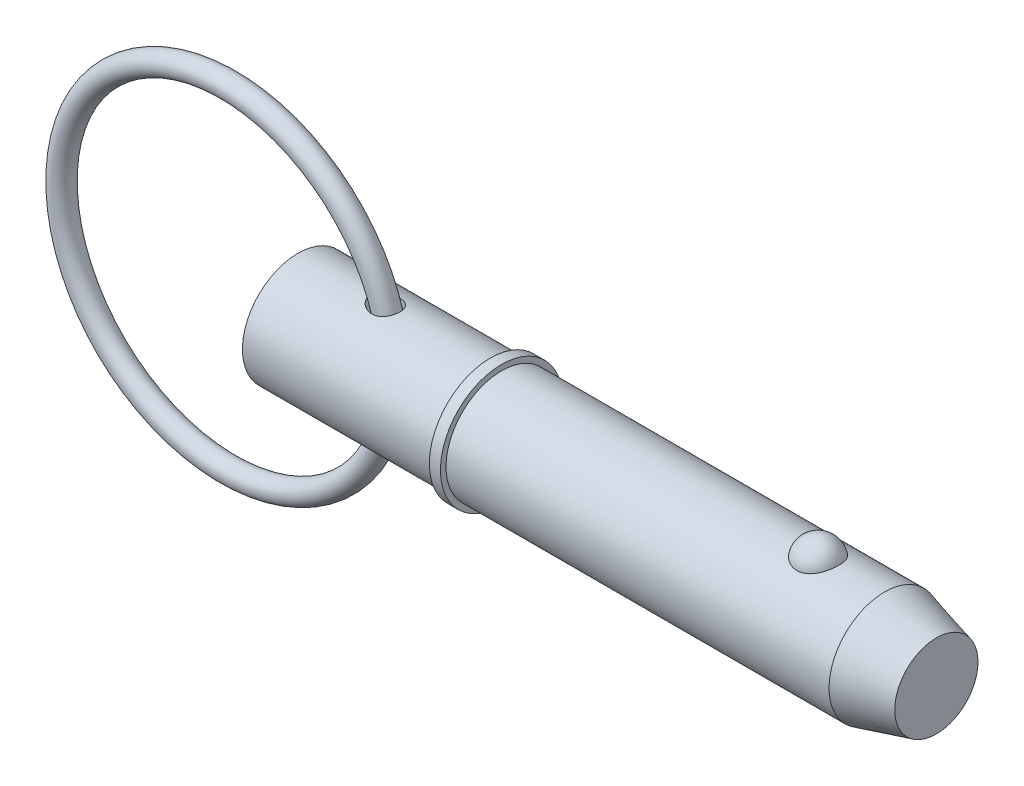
ISO-10303-21;
HEADER;
FILE_DESCRIPTION(('STEP AP214'),'2;1');
FILE_NAME('part.step','',(''),(''),'','','');
FILE_SCHEMA(('AUTOMOTIVE_DESIGN { 1 0 10303 214 1 1 1 1 }'));
ENDSEC;
DATA;
#1=APPLICATION_CONTEXT('core data for automotive mechanical design processes');
#2=APPLICATION_PROTOCOL_DEFINITION('international standard','automotive_design',2000,#1);
#3=PRODUCT_CONTEXT('',#1,'mechanical');
#4=PRODUCT('Part','Part','',(#3));
#5=PRODUCT_RELATED_PRODUCT_CATEGORY('part','',(#4));
#6=PRODUCT_DEFINITION_FORMATION('','',#4);
#7=PRODUCT_DEFINITION_CONTEXT('part definition',#1,'design');
#8=PRODUCT_DEFINITION('design','',#6,#7);
#9=PRODUCT_DEFINITION_SHAPE('','',#8);
#10=(LENGTH_UNIT() NAMED_UNIT(*) SI_UNIT(.MILLI.,.METRE.));
#11=(NAMED_UNIT(*) PLANE_ANGLE_UNIT() SI_UNIT($,.RADIAN.));
#12=(NAMED_UNIT(*) SI_UNIT($,.STERADIAN.) SOLID_ANGLE_UNIT());
#13=UNCERTAINTY_MEASURE_WITH_UNIT(LENGTH_MEASURE(1.E-05),#10,'distance_accuracy_value','');
#14=(GEOMETRIC_REPRESENTATION_CONTEXT(3) GLOBAL_UNCERTAINTY_ASSIGNED_CONTEXT((#13)) GLOBAL_UNIT_ASSIGNED_CONTEXT((#10,
#11,#12)) REPRESENTATION_CONTEXT('',''));
#15=CARTESIAN_POINT('',(0.,0.,0.));
#16=DIRECTION('',(0.,0.,1.));
#17=DIRECTION('',(1.,0.,0.));
#18=AXIS2_PLACEMENT_3D('',#15,#16,#17);
#19=CARTESIAN_POINT('',(-11.9894358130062,0.,0.));
#20=DIRECTION('',(0.,0.,1.));
#21=DIRECTION('',(1.,0.,0.));
#22=AXIS2_PLACEMENT_3D('',#19,#20,#21);
#23=TOROIDAL_SURFACE('',#22,28.575,1.905);
#24=CARTESIAN_POINT('',(18.4905641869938,0.,0.));
#25=VERTEX_POINT('',#24);
#26=VERTEX_LOOP('',#25);
#27=FACE_BOUND('',#26,.T.);
#28=ADVANCED_FACE('P0_F12',(#27),#23,.T.);
#29=CLOSED_SHELL('',(#28));
#30=MANIFOLD_SOLID_BREP('P0_B1',#29);
#31=CARTESIAN_POINT('',(0.,0.,0.));
#32=DIRECTION('',(1.,0.,0.));
#33=DIRECTION('',(0.,0.,-1.));
#34=AXIS2_PLACEMENT_3D('',#31,#32,#33);
#35=CYLINDRICAL_SURFACE('',#34,9.525);
#36=CARTESIAN_POINT('',(12.9513882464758,9.41921920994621,-1.41559473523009));
#37=CARTESIAN_POINT('',(13.0504692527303,9.40163924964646,-1.53256769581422));
#38=CARTESIAN_POINT('',(13.1602600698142,9.38319823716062,-1.64044593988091));
#39=CARTESIAN_POINT('',(13.3966485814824,9.34687220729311,-1.83618480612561));
#40=CARTESIAN_POINT('',(13.5232761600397,9.32898824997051,-1.92400906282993));
#41=CARTESIAN_POINT('',(13.78900694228,9.29593183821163,-2.07784697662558));
#42=CARTESIAN_POINT('',(13.9280753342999,9.28075215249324,-2.14391921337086));
#43=CARTESIAN_POINT('',(14.2153444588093,9.25488828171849,-2.25295850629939));
#44=CARTESIAN_POINT('',(14.3635415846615,9.24420233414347,-2.295934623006));
#45=CARTESIAN_POINT('',(14.669669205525,9.22859713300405,-2.3579005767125));
#46=CARTESIAN_POINT('',(14.8277567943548,9.22385123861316,-2.37617053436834));
#47=CARTESIAN_POINT('',(15.1447573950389,9.22170813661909,-2.38448481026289));
#48=CARTESIAN_POINT('',(15.3036699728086,9.22430739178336,-2.3745427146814));
#49=CARTESIAN_POINT('',(15.6046561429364,9.2363636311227,-2.32717331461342));
#50=CARTESIAN_POINT('',(15.7470893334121,9.24528216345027,-2.29190131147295));
#51=CARTESIAN_POINT('',(16.0228763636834,9.26842607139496,-2.19642882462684));
#52=CARTESIAN_POINT('',(16.1562346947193,9.28264879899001,-2.1362407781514));
#53=CARTESIAN_POINT('',(16.3991522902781,9.31332263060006,-1.99805318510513));
#54=CARTESIAN_POINT('',(16.5097585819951,9.32951023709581,-1.92182839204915));
#55=CARTESIAN_POINT('',(16.7159974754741,9.36298467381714,-1.75147176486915));
#56=CARTESIAN_POINT('',(16.811631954,9.38027136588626,-1.65734217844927));
#57=CARTESIAN_POINT('',(16.9833240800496,9.41356881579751,-1.45618916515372));
#58=CARTESIAN_POINT('',(17.0597719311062,9.42959946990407,-1.34950141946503));
#59=CARTESIAN_POINT('',(17.1939538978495,9.45905380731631,-1.1246201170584));
#60=CARTESIAN_POINT('',(17.2516877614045,9.4724774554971,-1.00642640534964));
#61=CARTESIAN_POINT('',(17.3474400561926,9.49535683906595,-0.760990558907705));
#62=CARTESIAN_POINT('',(17.3853184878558,9.50478431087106,-0.633691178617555));
#63=CARTESIAN_POINT('',(17.4399027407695,9.51852575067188,-0.374363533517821));
#64=CARTESIAN_POINT('',(17.4566077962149,9.52283953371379,-0.242335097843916));
#65=CARTESIAN_POINT('',(17.4685150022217,9.52590431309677,0.0235692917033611));
#66=CARTESIAN_POINT('',(17.4635842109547,9.52462091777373,0.157451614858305));
#67=CARTESIAN_POINT('',(17.4320243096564,9.5165501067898,0.422467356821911));
#68=CARTESIAN_POINT('',(17.4053947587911,9.50976257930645,0.553600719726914));
#69=CARTESIAN_POINT('',(17.3310009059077,9.49140797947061,0.809490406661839));
#70=CARTESIAN_POINT('',(17.2832204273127,9.47983724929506,0.93424176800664));
#71=CARTESIAN_POINT('',(17.1676219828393,9.45318034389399,1.1736825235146));
#72=CARTESIAN_POINT('',(17.0998044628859,9.43809424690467,1.28837214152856));
#73=CARTESIAN_POINT('',(16.9461013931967,9.40614962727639,1.50393386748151));
#74=CARTESIAN_POINT('',(16.8602910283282,9.38929862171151,1.6048606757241));
#75=CARTESIAN_POINT('',(16.6726759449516,9.35566510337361,1.79055313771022));
#76=CARTESIAN_POINT('',(16.5708731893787,9.33888258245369,1.87532077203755));
#77=CARTESIAN_POINT('',(16.3550631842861,9.30741331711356,2.02572386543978));
#78=CARTESIAN_POINT('',(16.2411701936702,9.29270956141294,2.09151983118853));
#79=CARTESIAN_POINT('',(16.0037488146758,9.26681293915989,2.20343355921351));
#80=CARTESIAN_POINT('',(15.8802207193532,9.25561996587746,2.24955191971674));
#81=CARTESIAN_POINT('',(15.6262451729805,9.23779438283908,2.32167613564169));
#82=CARTESIAN_POINT('',(15.4957570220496,9.23119272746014,2.34754561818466));
#83=CARTESIAN_POINT('',(15.2322153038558,9.22318493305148,2.37881082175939));
#84=CARTESIAN_POINT('',(15.0991611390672,9.22178001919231,2.3842017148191));
#85=CARTESIAN_POINT('',(14.8267609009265,9.22414647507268,2.37503099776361));
#86=CARTESIAN_POINT('',(14.6874545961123,9.22819578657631,2.35939810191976));
#87=CARTESIAN_POINT('',(14.412976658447,9.24129253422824,2.30756034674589));
#88=CARTESIAN_POINT('',(14.2778066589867,9.25034191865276,2.27134746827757));
#89=CARTESIAN_POINT('',(14.0027915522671,9.27334688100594,2.17561454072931));
#90=CARTESIAN_POINT('',(13.8635960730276,9.28766658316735,2.11431132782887));
#91=CARTESIAN_POINT('',(13.5969045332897,9.31925368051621,1.97041856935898));
#92=CARTESIAN_POINT('',(13.4694182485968,9.33652350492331,1.88781145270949));
#93=CARTESIAN_POINT('',(13.2243568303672,9.37286659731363,1.69844580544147));
#94=CARTESIAN_POINT('',(13.1075060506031,9.39198626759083,1.5907521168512));
#95=CARTESIAN_POINT('',(12.8957171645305,9.42881110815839,1.35544651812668));
#96=CARTESIAN_POINT('',(12.8007455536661,9.44651841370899,1.22786557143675));
#97=CARTESIAN_POINT('',(12.6580495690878,9.4741137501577,0.98872437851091));
#98=CARTESIAN_POINT('',(12.604453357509,9.4848570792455,0.880756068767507));
#99=CARTESIAN_POINT('',(12.515693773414,9.50295777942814,0.657225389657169));
#100=CARTESIAN_POINT('',(12.4805142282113,9.51031812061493,0.54166978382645));
#101=CARTESIAN_POINT('',(12.4305797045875,9.52083647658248,0.305475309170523));
#102=CARTESIAN_POINT('',(12.4159122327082,9.52397648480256,0.184816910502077));
#103=CARTESIAN_POINT('',(12.408320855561,9.52559626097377,-0.0572308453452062));
#104=CARTESIAN_POINT('',(12.4153963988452,9.52407614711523,-0.178620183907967));
#105=CARTESIAN_POINT('',(12.4495068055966,9.51684301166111,-0.409566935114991));
#106=CARTESIAN_POINT('',(12.4750931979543,9.51143444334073,-0.519353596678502));
#107=CARTESIAN_POINT('',(12.543120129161,9.49733710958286,-0.733285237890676));
#108=CARTESIAN_POINT('',(12.5855568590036,9.4886490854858,-0.837431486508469));
#109=CARTESIAN_POINT('',(12.6780792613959,9.47023833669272,-1.02356028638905));
#110=CARTESIAN_POINT('',(12.7261842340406,9.46084463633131,-1.10657511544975));
#111=CARTESIAN_POINT('',(12.8319313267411,9.44081892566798,-1.26610577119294));
#112=CARTESIAN_POINT('',(12.8895756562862,9.43018662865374,-1.34262008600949));
#113=CARTESIAN_POINT('',(12.9513882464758,9.41921920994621,-1.41559473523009));
#114=B_SPLINE_CURVE_WITH_KNOTS('',3,(#36,#37,#38,#39,#40,#41,#42,#43,#44,#45,#46,#47,#48,#49,
#50,#51,#52,#53,#54,#55,#56,#57,#58,#59,#60,#61,#62,#63,#64,#65,#66,#67,#68,#69,#70,#71,#72,#73,
#74,#75,#76,#77,#78,#79,#80,#81,#82,#83,#84,#85,#86,#87,#88,#89,#90,#91,#92,#93,#94,#95,#96,#97,
#98,#99,#100,#101,#102,#103,#104,#105,#106,#107,#108,#109,#110,#111,#112,#113),.UNSPECIFIED.,
.T.,.F.,(4,2,2,2,2,2,2,2,2,2,2,2,2,2,2,2,2,2,2,2,2,2,2,2,2,2,2,2,2,2,2,2,2,2,2,2,2,2,4),(0.,
0.462524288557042,0.925880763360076,1.3879789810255,1.84989578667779,2.32500103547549,
2.79987752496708,3.23851602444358,3.67693583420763,4.08084875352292,4.48471100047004,
4.87953549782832,5.27436531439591,5.67194282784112,6.0695347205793,6.46957303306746,
6.86961947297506,7.26997240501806,7.67031642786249,8.06901977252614,8.46767421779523,
8.86284969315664,9.25801315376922,9.65581560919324,10.0537118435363,10.4726706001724,
10.8917927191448,11.3481090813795,11.8048030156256,12.2824769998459,12.7594145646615,
13.1209614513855,13.4821903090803,13.8449555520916,14.2077115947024,14.5447865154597,
14.881785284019,15.170268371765,15.4588183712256),.UNSPECIFIED.);
#115=CARTESIAN_POINT('',(12.9513882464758,9.41921920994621,-1.41559473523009));
#116=VERTEX_POINT('',#115);
#117=EDGE_CURVE('P1_E42',#116,#116,#114,.T.);
#118=ORIENTED_EDGE('',*,*,#117,.T.);
#119=EDGE_LOOP('',(#118));
#120=FACE_BOUND('',#119,.T.);
#121=CARTESIAN_POINT('',(0.,0.,0.));
#122=DIRECTION('',(1.,0.,0.));
#123=DIRECTION('',(0.,0.,-1.));
#124=AXIS2_PLACEMENT_3D('',#121,#122,#123);
#125=CIRCLE('',#124,9.525);
#126=CARTESIAN_POINT('',(0.,0.,-9.525));
#127=VERTEX_POINT('',#126);
#128=EDGE_CURVE('P1_E9',#127,#127,#125,.T.);
#129=ORIENTED_EDGE('',*,*,#128,.T.);
#130=EDGE_LOOP('',(#129));
#131=FACE_BOUND('',#130,.T.);
#132=CARTESIAN_POINT('',(33.025,0.,0.));
#133=DIRECTION('',(1.,0.,0.));
#134=DIRECTION('',(0.,0.,-1.));
#135=AXIS2_PLACEMENT_3D('',#132,#133,#134);
#136=CIRCLE('',#135,9.525);
#137=CARTESIAN_POINT('',(33.025,0.,-9.525));
#138=VERTEX_POINT('',#137);
#139=EDGE_CURVE('P1_E25',#138,#138,#136,.T.);
#140=ORIENTED_EDGE('',*,*,#139,.F.);
#141=EDGE_LOOP('',(#140));
#142=FACE_BOUND('',#141,.T.);
#143=CARTESIAN_POINT('',(12.9513882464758,-9.41921920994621,-1.41559473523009));
#144=CARTESIAN_POINT('',(12.8706569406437,-9.43354320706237,-1.32028288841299));
#145=CARTESIAN_POINT('',(12.7970077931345,-9.44729974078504,-1.21890449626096));
#146=CARTESIAN_POINT('',(12.6667099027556,-9.47239055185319,-1.00546491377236));
#147=CARTESIAN_POINT('',(12.6100480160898,-9.48372669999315,-0.893412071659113));
#148=CARTESIAN_POINT('',(12.5163428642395,-9.50281544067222,-0.660202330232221));
#149=CARTESIAN_POINT('',(12.4794216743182,-9.51054569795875,-0.538993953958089));
#150=CARTESIAN_POINT('',(12.4282252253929,-9.52133525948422,-0.29167282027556));
#151=CARTESIAN_POINT('',(12.4139371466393,-9.52439720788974,-0.165562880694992));
#152=CARTESIAN_POINT('',(12.4092595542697,-9.52539668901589,0.0763263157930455));
#153=CARTESIAN_POINT('',(12.4169377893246,-9.5237485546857,0.192070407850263));
#154=CARTESIAN_POINT('',(12.4515961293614,-9.51640070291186,0.420478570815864));
#155=CARTESIAN_POINT('',(12.4785770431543,-9.51070081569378,0.533142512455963));
#156=CARTESIAN_POINT('',(12.5496371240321,-9.49599978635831,0.750537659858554));
#157=CARTESIAN_POINT('',(12.5934215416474,-9.48705569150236,0.855370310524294));
#158=CARTESIAN_POINT('',(12.6960201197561,-9.46670226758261,1.05710432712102));
#159=CARTESIAN_POINT('',(12.754838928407,-9.45529217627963,1.15400322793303));
#160=CARTESIAN_POINT('',(12.8926588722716,-9.42958102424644,1.34883014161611));
#161=CARTESIAN_POINT('',(12.9731843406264,-9.41509922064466,1.44565277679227));
#162=CARTESIAN_POINT('',(13.1473692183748,-9.38554264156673,1.62653953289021));
#163=CARTESIAN_POINT('',(13.2410364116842,-9.37046751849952,1.71059603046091));
#164=CARTESIAN_POINT('',(13.454392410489,-9.33867330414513,1.87697964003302));
#165=CARTESIAN_POINT('',(13.5758667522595,-9.32205896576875,1.95704323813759));
#166=CARTESIAN_POINT('',(13.8299208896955,-9.29140277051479,2.09777392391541));
#167=CARTESIAN_POINT('',(13.9625074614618,-9.27736250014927,2.15842906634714));
#168=CARTESIAN_POINT('',(14.2477938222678,-9.25234849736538,2.26337318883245));
#169=CARTESIAN_POINT('',(14.4012368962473,-9.2417532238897,2.30575283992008));
#170=CARTESIAN_POINT('',(14.7134258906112,-9.22706044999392,2.36387471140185));
#171=CARTESIAN_POINT('',(14.8721705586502,-9.22296142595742,2.37962317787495));
#172=CARTESIAN_POINT('',(15.1841930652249,-9.22219798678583,2.3825815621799));
#173=CARTESIAN_POINT('',(15.3374581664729,-9.22526675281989,2.37081567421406));
#174=CARTESIAN_POINT('',(15.6390558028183,-9.23821642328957,2.31984408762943));
#175=CARTESIAN_POINT('',(15.7873916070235,-9.24809271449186,2.28065697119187));
#176=CARTESIAN_POINT('',(16.0605055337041,-9.27231045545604,2.17997072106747));
#177=CARTESIAN_POINT('',(16.1861988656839,-9.28616347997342,2.12082794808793));
#178=CARTESIAN_POINT('',(16.4248737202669,-9.31689725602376,1.98144352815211));
#179=CARTESIAN_POINT('',(16.5378583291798,-9.33377726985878,1.90120701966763));
#180=CARTESIAN_POINT('',(16.7424913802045,-9.36766057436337,1.72629138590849));
#181=CARTESIAN_POINT('',(16.8349077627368,-9.38461836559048,1.63249912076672));
#182=CARTESIAN_POINT('',(17.0025959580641,-9.41752009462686,1.43052052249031));
#183=CARTESIAN_POINT('',(17.0778684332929,-9.43346407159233,1.32233474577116));
#184=CARTESIAN_POINT('',(17.2093311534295,-9.46256896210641,1.09477833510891));
#185=CARTESIAN_POINT('',(17.2655443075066,-9.47573320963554,0.975421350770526));
#186=CARTESIAN_POINT('',(17.3577240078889,-9.49788660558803,0.72876499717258));
#187=CARTESIAN_POINT('',(17.3936897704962,-9.5068755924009,0.601465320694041));
#188=CARTESIAN_POINT('',(17.4447894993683,-9.51977728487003,0.341392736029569));
#189=CARTESIAN_POINT('',(17.4597470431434,-9.52364698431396,0.208583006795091));
#190=CARTESIAN_POINT('',(17.467935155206,-9.52575588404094,-0.0577507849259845));
#191=CARTESIAN_POINT('',(17.4611651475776,-9.52399493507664,-0.191274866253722));
#192=CARTESIAN_POINT('',(17.4259933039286,-9.51501704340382,-0.455658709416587));
#193=CARTESIAN_POINT('',(17.3975278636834,-9.50778405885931,-0.586509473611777));
#194=CARTESIAN_POINT('',(17.3195245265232,-9.48862442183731,-0.841413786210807));
#195=CARTESIAN_POINT('',(17.2699864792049,-9.47669773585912,-0.965467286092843));
#196=CARTESIAN_POINT('',(17.1510794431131,-9.44947793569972,-1.20302860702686));
#197=CARTESIAN_POINT('',(17.0817421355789,-9.43419020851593,-1.31655289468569));
#198=CARTESIAN_POINT('',(16.9249035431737,-9.40193593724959,-1.52999797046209));
#199=CARTESIAN_POINT('',(16.8374037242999,-9.38496952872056,-1.62991985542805));
#200=CARTESIAN_POINT('',(16.6472525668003,-9.35139745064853,-1.81261591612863));
#201=CARTESIAN_POINT('',(16.544718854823,-9.33479003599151,-1.89551219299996));
#202=CARTESIAN_POINT('',(16.3268885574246,-9.30366076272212,-2.04284430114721));
#203=CARTESIAN_POINT('',(16.2115933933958,-9.28913867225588,-2.10728218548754));
#204=CARTESIAN_POINT('',(15.9721327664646,-9.26380878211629,-2.21598517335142));
#205=CARTESIAN_POINT('',(15.8480095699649,-9.25298455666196,-2.26033977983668));
#206=CARTESIAN_POINT('',(15.5939970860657,-9.23601616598,-2.32870721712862));
#207=CARTESIAN_POINT('',(15.4641070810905,-9.22987258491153,-2.35271750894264));
#208=CARTESIAN_POINT('',(15.1982340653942,-9.22261892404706,-2.38099747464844));
#209=CARTESIAN_POINT('',(15.0621840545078,-9.22166165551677,-2.38466791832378));
#210=CARTESIAN_POINT('',(14.7911713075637,-9.22504733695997,-2.37153091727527));
#211=CARTESIAN_POINT('',(14.6562088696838,-9.22939169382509,-2.35471803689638));
#212=CARTESIAN_POINT('',(14.3799999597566,-9.24325361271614,-2.29972931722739));
#213=CARTESIAN_POINT('',(14.2390842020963,-9.25314817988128,-2.25998976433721));
#214=CARTESIAN_POINT('',(13.9651910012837,-9.2770918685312,-2.15959208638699));
#215=CARTESIAN_POINT('',(13.8322212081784,-9.29114491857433,-2.09891417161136));
#216=CARTESIAN_POINT('',(13.5621642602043,-9.32369066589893,-1.94960068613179));
#217=CARTESIAN_POINT('',(13.4264724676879,-9.34251276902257,-1.85849626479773));
#218=CARTESIAN_POINT('',(13.1736579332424,-9.38095091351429,-1.6535412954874));
#219=CARTESIAN_POINT('',(13.0565182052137,-9.40056620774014,-1.53971177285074));
#220=CARTESIAN_POINT('',(12.9513882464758,-9.41921920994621,-1.41559473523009));
#221=B_SPLINE_CURVE_WITH_KNOTS('',3,(#143,#144,#145,#146,#147,#148,#149,#150,#151,#152,#153,
#154,#155,#156,#157,#158,#159,#160,#161,#162,#163,#164,#165,#166,#167,#168,#169,#170,#171,#172,
#173,#174,#175,#176,#177,#178,#179,#180,#181,#182,#183,#184,#185,#186,#187,#188,#189,#190,#191,
#192,#193,#194,#195,#196,#197,#198,#199,#200,#201,#202,#203,#204,#205,#206,#207,#208,#209,#210,
#211,#212,#213,#214,#215,#216,#217,#218,#219,#220),.UNSPECIFIED.,.T.,.F.,(4,2,2,2,2,2,2,2,2,2,2,
2,2,2,2,2,2,2,2,2,2,2,2,2,2,2,2,2,2,2,2,2,2,2,2,2,2,2,4),(0.,0.37674646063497,0.753200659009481,
1.13195666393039,1.51049805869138,1.85679105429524,2.20309856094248,2.54359033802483,
2.88418751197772,3.26301611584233,3.64207005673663,4.07954912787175,4.51729693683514,
4.99355673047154,5.46970480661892,5.92841231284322,6.38680927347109,6.80346940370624,
7.2200281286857,7.61642768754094,8.01281192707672,8.4087180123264,8.8046394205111,
9.20386620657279,9.60310357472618,10.0035159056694,10.4039310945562,10.8037091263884,
11.2034549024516,11.6002252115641,11.9969513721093,12.3918916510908,12.7868812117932,
13.1934480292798,13.6001227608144,14.038511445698,14.4773156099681,14.9683748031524,
15.4589817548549),.UNSPECIFIED.);
#222=CARTESIAN_POINT('',(12.9513882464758,-9.41921920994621,-1.41559473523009));
#223=VERTEX_POINT('',#222);
#224=EDGE_CURVE('P1_E17',#223,#223,#221,.T.);
#225=ORIENTED_EDGE('',*,*,#224,.T.);
#226=EDGE_LOOP('',(#225));
#227=FACE_BOUND('',#226,.T.);
#228=ADVANCED_FACE('P1_F13',(#120,#131,#142,#227),#35,.T.);
#229=CARTESIAN_POINT('',(0.,0.,0.));
#230=DIRECTION('',(1.,0.,0.));
#231=DIRECTION('',(0.,0.,-1.));
#232=AXIS2_PLACEMENT_3D('',#229,#230,#231);
#233=CYLINDRICAL_SURFACE('',#232,9.525);
#234=CARTESIAN_POINT('',(100.643054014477,0.,0.));
#235=DIRECTION('',(1.,0.,0.));
#236=DIRECTION('',(0.,0.,-1.));
#237=AXIS2_PLACEMENT_3D('',#234,#235,#236);
#238=CIRCLE('',#237,9.525);
#239=CARTESIAN_POINT('',(100.643054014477,0.,-9.525));
#240=VERTEX_POINT('',#239);
#241=EDGE_CURVE('P1_E99',#240,#240,#238,.T.);
#242=ORIENTED_EDGE('',*,*,#241,.F.);
#243=EDGE_LOOP('',(#242));
#244=FACE_BOUND('',#243,.T.);
#245=CARTESIAN_POINT('',(34.93,0.,0.));
#246=DIRECTION('',(1.,0.,0.));
#247=DIRECTION('',(0.,0.,-1.));
#248=AXIS2_PLACEMENT_3D('',#245,#246,#247);
#249=CIRCLE('',#248,9.525);
#250=CARTESIAN_POINT('',(34.93,0.,-9.525));
#251=VERTEX_POINT('',#250);
#252=EDGE_CURVE('P1_E96',#251,#251,#249,.T.);
#253=ORIENTED_EDGE('',*,*,#252,.T.);
#254=EDGE_LOOP('',(#253));
#255=FACE_BOUND('',#254,.T.);
#256=CARTESIAN_POINT('',(89.2457573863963,8.80405803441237,3.63513233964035));
#257=CARTESIAN_POINT('',(89.1516766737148,8.80405953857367,3.63513053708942));
#258=CARTESIAN_POINT('',(89.0575618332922,8.80561325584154,3.6313746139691));
#259=CARTESIAN_POINT('',(88.8700126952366,8.81177748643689,3.61638665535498));
#260=CARTESIAN_POINT('',(88.7765788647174,8.81638992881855,3.60514990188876));
#261=CARTESIAN_POINT('',(88.4979452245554,8.8346711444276,3.56024627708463));
#262=CARTESIAN_POINT('',(88.3146916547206,8.85278327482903,3.51538626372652));
#263=CARTESIAN_POINT('',(87.9595099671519,8.89871214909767,3.39742145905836));
#264=CARTESIAN_POINT('',(87.7875533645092,8.92650327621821,3.32439116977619));
#265=CARTESIAN_POINT('',(87.458707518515,8.98874819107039,3.15220244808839));
#266=CARTESIAN_POINT('',(87.3018114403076,9.02319893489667,3.05305594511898));
#267=CARTESIAN_POINT('',(87.0022147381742,9.09629186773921,2.82797815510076));
#268=CARTESIAN_POINT('',(86.8600600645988,9.13502685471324,2.70135138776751));
#269=CARTESIAN_POINT('',(86.5982999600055,9.2118657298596,2.42641932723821));
#270=CARTESIAN_POINT('',(86.4787015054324,9.2499694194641,2.27810735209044));
#271=CARTESIAN_POINT('',(86.259645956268,9.32341082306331,1.95652290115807));
#272=CARTESIAN_POINT('',(86.1613174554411,9.35855090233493,1.78243511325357));
#273=CARTESIAN_POINT('',(85.9938190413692,9.42045142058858,1.41937246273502));
#274=CARTESIAN_POINT('',(85.9246511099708,9.44721128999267,1.23039658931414));
#275=CARTESIAN_POINT('',(85.8161994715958,9.48990641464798,0.840370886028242));
#276=CARTESIAN_POINT('',(85.7772880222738,9.50570658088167,0.639202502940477));
#277=CARTESIAN_POINT('',(85.7315550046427,9.52433146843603,0.232664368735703));
#278=CARTESIAN_POINT('',(85.7247324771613,9.52715657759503,0.0272947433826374));
#279=CARTESIAN_POINT('',(85.743255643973,9.51956918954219,-0.380478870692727));
#280=CARTESIAN_POINT('',(85.7684052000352,9.50923740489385,-0.582893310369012));
#281=CARTESIAN_POINT('',(85.8500253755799,9.47651897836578,-0.98029399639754));
#282=CARTESIAN_POINT('',(85.9064966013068,9.45413210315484,-1.17528009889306));
#283=CARTESIAN_POINT('',(86.0497192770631,9.39954044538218,-1.55263697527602));
#284=CARTESIAN_POINT('',(86.1365124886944,9.36732213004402,-1.73498993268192));
#285=CARTESIAN_POINT('',(86.3386103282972,9.29640700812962,-2.08177763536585));
#286=CARTESIAN_POINT('',(86.4539172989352,9.25770966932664,-2.24621090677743));
#287=CARTESIAN_POINT('',(86.711264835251,9.17775604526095,-2.55338333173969));
#288=CARTESIAN_POINT('',(86.8534344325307,9.136488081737,-2.69601150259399));
#289=CARTESIAN_POINT('',(87.16089985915,9.05620497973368,-2.95451229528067));
#290=CARTESIAN_POINT('',(87.3261937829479,9.01718965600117,-3.07038711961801));
#291=CARTESIAN_POINT('',(87.672052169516,8.94680019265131,-3.26976836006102));
#292=CARTESIAN_POINT('',(87.8522278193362,8.91528408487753,-3.353897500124));
#293=CARTESIAN_POINT('',(88.2256514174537,8.86272514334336,-3.49043503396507));
#294=CARTESIAN_POINT('',(88.4188944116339,8.84167836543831,-3.54285537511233));
#295=CARTESIAN_POINT('',(88.8025036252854,8.81348056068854,-3.61241306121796));
#296=CARTESIAN_POINT('',(88.9925251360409,8.80568348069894,-3.63119339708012));
#297=CARTESIAN_POINT('',(89.3731906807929,8.80289410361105,-3.63795342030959));
#298=CARTESIAN_POINT('',(89.5638345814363,8.80789922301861,-3.62593932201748));
#299=CARTESIAN_POINT('',(89.9340076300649,8.82974915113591,-3.57238430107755));
#300=CARTESIAN_POINT('',(90.1136976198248,8.84621463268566,-3.53178890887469));
#301=CARTESIAN_POINT('',(90.463422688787,8.88875330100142,-3.42331083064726));
#302=CARTESIAN_POINT('',(90.6334569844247,8.91482726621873,-3.35542593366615));
#303=CARTESIAN_POINT('',(90.9632377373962,8.97448239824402,-3.19248225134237));
#304=CARTESIAN_POINT('',(91.1226801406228,9.00821446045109,-3.09686474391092));
#305=CARTESIAN_POINT('',(91.4235136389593,9.07935398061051,-2.88162736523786));
#306=CARTESIAN_POINT('',(91.5649005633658,9.11676228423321,-2.76200196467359));
#307=CARTESIAN_POINT('',(91.8333193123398,9.19347419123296,-2.49516285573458));
#308=CARTESIAN_POINT('',(91.9592750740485,9.23277872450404,-2.34686614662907));
#309=CARTESIAN_POINT('',(92.1855227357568,9.30737610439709,-2.03093683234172));
#310=CARTESIAN_POINT('',(92.2858100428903,9.34266823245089,-1.86330077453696));
#311=CARTESIAN_POINT('',(92.4615149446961,9.40674710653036,-1.50744893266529));
#312=CARTESIAN_POINT('',(92.536041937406,9.43529176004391,-1.31874876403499));
#313=CARTESIAN_POINT('',(92.6541650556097,9.48144132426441,-0.930631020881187));
#314=CARTESIAN_POINT('',(92.6977608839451,9.49904612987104,-0.731213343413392));
#315=CARTESIAN_POINT('',(92.7531580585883,9.5215314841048,-0.327147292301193));
#316=CARTESIAN_POINT('',(92.7649354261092,9.52640243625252,-0.12249509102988));
#317=CARTESIAN_POINT('',(92.7563825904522,9.5228957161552,0.286018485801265));
#318=CARTESIAN_POINT('',(92.7360530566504,9.5145183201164,0.489879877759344));
#319=CARTESIAN_POINT('',(92.6638840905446,9.48544083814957,0.889994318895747));
#320=CARTESIAN_POINT('',(92.6121993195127,9.46480124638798,1.08627971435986));
#321=CARTESIAN_POINT('',(92.4784917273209,9.4133389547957,1.46682086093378));
#322=CARTESIAN_POINT('',(92.3964668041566,9.38251554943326,1.65107577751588));
#323=CARTESIAN_POINT('',(92.2031929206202,9.31365636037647,2.00346348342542));
#324=CARTESIAN_POINT('',(92.0917838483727,9.27558138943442,2.17150083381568));
#325=CARTESIAN_POINT('',(91.8422947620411,9.19638714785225,2.48563115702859));
#326=CARTESIAN_POINT('',(91.7042163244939,9.15526805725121,2.63172542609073));
#327=CARTESIAN_POINT('',(91.4048438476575,9.07465393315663,2.89750997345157));
#328=CARTESIAN_POINT('',(91.2436109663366,9.03515496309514,3.01726776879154));
#329=CARTESIAN_POINT('',(90.9016136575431,8.96227564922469,3.22732920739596));
#330=CARTESIAN_POINT('',(90.720841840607,8.92889763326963,3.31762165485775));
#331=CARTESIAN_POINT('',(90.3514451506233,8.8734538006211,3.46314419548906));
#332=CARTESIAN_POINT('',(90.1633237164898,8.85102983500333,3.51950082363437));
#333=CARTESIAN_POINT('',(89.8757869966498,8.8266696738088,3.57993683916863));
#334=CARTESIAN_POINT('',(89.7791339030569,8.82009725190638,3.59606217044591));
#335=CARTESIAN_POINT('',(89.5846770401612,8.81020897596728,3.62022512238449));
#336=CARTESIAN_POINT('',(89.4868741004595,8.80689090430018,3.62826825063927));
#337=CARTESIAN_POINT('',(89.3412243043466,8.80445615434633,3.63416760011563));
#338=CARTESIAN_POINT('',(89.2934952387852,8.80405727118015,3.63513325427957));
#339=CARTESIAN_POINT('',(89.2457573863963,8.80405803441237,3.63513233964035));
#340=B_SPLINE_CURVE_WITH_KNOTS('',3,(#256,#257,#258,#259,#260,#261,#262,#263,#264,#265,#266,
#267,#268,#269,#270,#271,#272,#273,#274,#275,#276,#277,#278,#279,#280,#281,#282,#283,#284,#285,
#286,#287,#288,#289,#290,#291,#292,#293,#294,#295,#296,#297,#298,#299,#300,#301,#302,#303,#304,
#305,#306,#307,#308,#309,#310,#311,#312,#313,#314,#315,#316,#317,#318,#319,#320,#321,#322,#323,
#324,#325,#326,#327,#328,#329,#330,#331,#332,#333,#334,#335,#336,#337,#338,#339),.UNSPECIFIED.,
.T.,.F.,(4,2,2,2,2,2,2,2,2,2,2,2,2,2,2,2,2,2,2,2,2,2,2,2,2,2,2,2,2,2,2,2,2,2,2,2,2,2,2,2,2,4),
(0.,0.282202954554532,0.564584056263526,1.13017050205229,1.69427128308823,2.25811483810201,
2.83836627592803,3.41879688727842,4.02497117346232,4.63118665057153,5.24474754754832,
5.85829010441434,6.46808687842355,7.07789545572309,7.68854723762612,8.29924920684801,
8.9129628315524,9.52662591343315,10.1275338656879,10.7282152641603,11.2986646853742,
11.868998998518,12.4213015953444,12.973648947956,13.5380053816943,14.1024919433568,
14.695298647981,15.2882113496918,15.8999469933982,16.5116885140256,17.1238909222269,
17.7360805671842,18.3452748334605,18.9545113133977,19.567138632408,20.1797297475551,
20.7907316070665,21.4019653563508,21.9915938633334,22.2859053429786,22.5800161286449,
22.723209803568),.UNSPECIFIED.);
#341=CARTESIAN_POINT('',(89.2457573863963,8.80405803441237,3.63513233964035));
#342=VERTEX_POINT('',#341);
#343=EDGE_CURVE('P1_E34',#342,#342,#340,.T.);
#344=ORIENTED_EDGE('',*,*,#343,.T.);
#345=EDGE_LOOP('',(#344));
#346=FACE_BOUND('',#345,.T.);
#347=ADVANCED_FACE('P1_F46',(#244,#255,#346),#233,.T.);
#348=CARTESIAN_POINT('',(0.,0.,0.));
#349=DIRECTION('',(-1.,0.,0.));
#350=DIRECTION('',(0.,0.,1.));
#351=AXIS2_PLACEMENT_3D('',#348,#349,#350);
#352=PLANE('',#351);
#353=ORIENTED_EDGE('',*,*,#128,.F.);
#354=EDGE_LOOP('',(#353));
#355=FACE_BOUND('',#354,.T.);
#356=ADVANCED_FACE('P1_F15',(#355),#352,.T.);
#357=CARTESIAN_POINT('',(33.025,9.525,0.));
#358=DIRECTION('',(-1.,0.,0.));
#359=DIRECTION('',(0.,0.,1.));
#360=AXIS2_PLACEMENT_3D('',#357,#358,#359);
#361=PLANE('',#360);
#362=ORIENTED_EDGE('',*,*,#139,.T.);
#363=EDGE_LOOP('',(#362));
#364=FACE_BOUND('',#363,.T.);
#365=CARTESIAN_POINT('',(33.025,0.,0.));
#366=DIRECTION('',(1.,0.,0.));
#367=DIRECTION('',(0.,0.,-1.));
#368=AXIS2_PLACEMENT_3D('',#365,#366,#367);
#369=CIRCLE('',#368,10.4775);
#370=CARTESIAN_POINT('',(33.025,0.,-10.4775));
#371=VERTEX_POINT('',#370);
#372=EDGE_CURVE('P1_E30',#371,#371,#369,.T.);
#373=ORIENTED_EDGE('',*,*,#372,.F.);
#374=EDGE_LOOP('',(#373));
#375=FACE_BOUND('',#374,.T.);
#376=ADVANCED_FACE('P1_F81',(#364,#375),#361,.T.);
#377=CARTESIAN_POINT('',(0.,0.,0.));
#378=DIRECTION('',(1.,0.,0.));
#379=DIRECTION('',(0.,0.,-1.));
#380=AXIS2_PLACEMENT_3D('',#377,#378,#379);
#381=CYLINDRICAL_SURFACE('',#380,10.4775);
#382=ORIENTED_EDGE('',*,*,#372,.T.);
#383=EDGE_LOOP('',(#382));
#384=FACE_BOUND('',#383,.T.);
#385=CARTESIAN_POINT('',(34.93,0.,0.));
#386=DIRECTION('',(1.,0.,0.));
#387=DIRECTION('',(0.,0.,-1.));
#388=AXIS2_PLACEMENT_3D('',#385,#386,#387);
#389=CIRCLE('',#388,10.4775);
#390=CARTESIAN_POINT('',(34.93,0.,-10.4775));
#391=VERTEX_POINT('',#390);
#392=EDGE_CURVE('P1_E95',#391,#391,#389,.T.);
#393=ORIENTED_EDGE('',*,*,#392,.F.);
#394=EDGE_LOOP('',(#393));
#395=FACE_BOUND('',#394,.T.);
#396=ADVANCED_FACE('P1_F68',(#384,#395),#381,.T.);
#397=CARTESIAN_POINT('',(34.93,10.4775,0.));
#398=DIRECTION('',(1.,0.,0.));
#399=DIRECTION('',(0.,0.,-1.));
#400=AXIS2_PLACEMENT_3D('',#397,#398,#399);
#401=PLANE('',#400);
#402=ORIENTED_EDGE('',*,*,#392,.T.);
#403=EDGE_LOOP('',(#402));
#404=FACE_BOUND('',#403,.T.);
#405=ORIENTED_EDGE('',*,*,#252,.F.);
#406=EDGE_LOOP('',(#405));
#407=FACE_BOUND('',#406,.T.);
#408=ADVANCED_FACE('P1_F62',(#404,#407),#401,.T.);
#409=CARTESIAN_POINT('',(109.53,0.,0.));
#410=DIRECTION('',(-1.,0.,0.));
#411=DIRECTION('',(0.,0.,1.));
#412=AXIS2_PLACEMENT_3D('',#409,#410,#411);
#413=CONICAL_SURFACE('',#412,7.14375000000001,0.261799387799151);
#414=ORIENTED_EDGE('',*,*,#241,.T.);
#415=EDGE_LOOP('',(#414));
#416=FACE_BOUND('',#415,.T.);
#417=CARTESIAN_POINT('',(109.53,0.,0.));
#418=DIRECTION('',(1.,0.,0.));
#419=DIRECTION('',(0.,0.,-1.));
#420=AXIS2_PLACEMENT_3D('',#417,#418,#419);
#421=CIRCLE('',#420,7.14375000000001);
#422=CARTESIAN_POINT('',(109.53,0.,-7.14375000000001));
#423=VERTEX_POINT('',#422);
#424=EDGE_CURVE('P1_E41',#423,#423,#421,.T.);
#425=ORIENTED_EDGE('',*,*,#424,.F.);
#426=EDGE_LOOP('',(#425));
#427=FACE_BOUND('',#426,.T.);
#428=ADVANCED_FACE('P1_F59',(#416,#427),#413,.T.);
#429=CARTESIAN_POINT('',(109.53,7.14375000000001,0.));
#430=DIRECTION('',(1.,0.,0.));
#431=DIRECTION('',(0.,0.,-1.));
#432=AXIS2_PLACEMENT_3D('',#429,#430,#431);
#433=PLANE('',#432);
#434=ORIENTED_EDGE('',*,*,#424,.T.);
#435=EDGE_LOOP('',(#434));
#436=FACE_BOUND('',#435,.T.);
#437=ADVANCED_FACE('P1_F55',(#436),#433,.T.);
#438=CARTESIAN_POINT('',(89.2457573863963,8.57249999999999,0.));
#439=DIRECTION('',(-1.,0.,0.));
#440=DIRECTION('',(0.,1.,0.));
#441=AXIS2_PLACEMENT_3D('',#438,#439,#440);
#442=SPHERICAL_SURFACE('',#441,3.64250000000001);
#443=ORIENTED_EDGE('',*,*,#343,.F.);
#444=EDGE_LOOP('',(#443));
#445=FACE_BOUND('',#444,.T.);
#446=ADVANCED_FACE('P1_F50',(#445),#442,.T.);
#447=CARTESIAN_POINT('',(-11.9894358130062,0.,0.));
#448=DIRECTION('',(0.,0.,1.));
#449=DIRECTION('',(1.,0.,0.));
#450=AXIS2_PLACEMENT_3D('',#447,#448,#449);
#451=TOROIDAL_SURFACE('',#450,28.575,2.38125);
#452=ORIENTED_EDGE('',*,*,#224,.F.);
#453=EDGE_LOOP('',(#452));
#454=FACE_BOUND('',#453,.T.);
#455=ORIENTED_EDGE('',*,*,#117,.F.);
#456=EDGE_LOOP('',(#455));
#457=FACE_BOUND('',#456,.T.);
#458=ADVANCED_FACE('P1_F54',(#454,#457),#451,.F.);
#459=CLOSED_SHELL('',(#228,#347,#356,#376,#396,#408,#428,#437,#446,#458));
#460=MANIFOLD_SOLID_BREP('P1_B1',#459);
#461=ADVANCED_BREP_SHAPE_REPRESENTATION('',(#18,#30,#460),#14);
#462=SHAPE_DEFINITION_REPRESENTATION(#9,#461);
ENDSEC;
END-ISO-10303-21;
